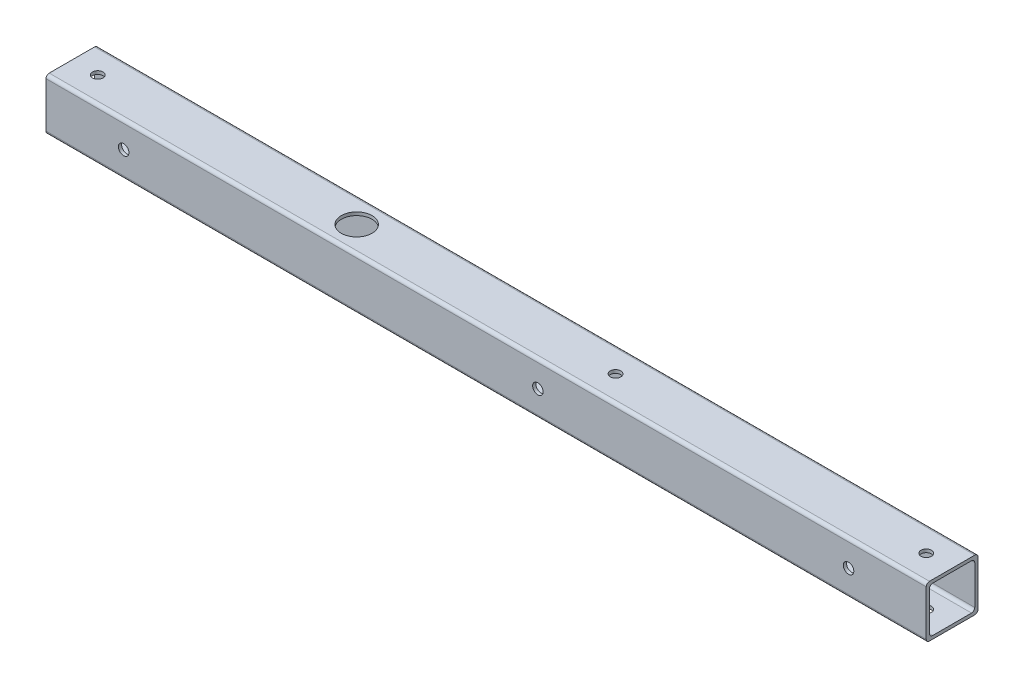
from build123d import *

# Parameters (mm, degrees)
SKETCH1_W          = 1727.2
SKETCH1_H          = 101.6
EXTRUDE1_DEPTH     = 101.6
CUT_EXTRUDE1_REACH = 1735.166
SKETCH2_W          = 88.9
SKETCH2_H          = 88.9
FILLET1_R          = 6.35
SKETCH3_R          = 10.31875
CUT_EXTRUDE2_DEPTH = 101.6
SKETCH4_R          = 10.31875
CUT_EXTRUDE3_DEPTH = 101.6
SKETCH5_R          = 30.1625
CUT_EXTRUDE4_DEPTH = 101.6
SKETCH6_R          = 10.31875
CUT_EXTRUDE5_DEPTH = 101.6
SKETCH7_R          = 10.31875
CUT_EXTRUDE6_DEPTH = 101.6
SKETCH8_R          = 10.31875
CUT_EXTRUDE7_DEPTH = 101.6
SKETCH9_R          = 10.31875
CUT_EXTRUDE8_DEPTH = 101.6


with BuildPart() as part:
    # Sketch1 → Extrude1 (new body)
    with BuildSketch(Plane(origin=(0, 0, 0), x_dir=(1, 0, 0), z_dir=(0, 1, 0))):
        with Locations((-863.6, -50.8)):
            Rectangle(SKETCH1_W, SKETCH1_H)
    extrude(amount=EXTRUDE1_DEPTH)

    # Sketch2 → Cut-Extrude1 (cut, up to next)
    with BuildSketch(Plane.ZY.offset(1727.2), mode=Mode.PRIVATE) as cut_extrude1_sk1:
        with Locations((50.8, 50.8)):
            Rectangle(SKETCH2_W, SKETCH2_H)
    cut_extrude1_tool1 = extrude(cut_extrude1_sk1.sketch, amount=-CUT_EXTRUDE1_REACH, mode=Mode.PRIVATE) & part.part
    add(cut_extrude1_tool1.solids().sort_by_distance((-1727.2, 50.8, 50.8))[0], mode=Mode.SUBTRACT)

    # Fillet1
    fillet1_edges = [part.edges().sort_by_distance(p)[0] for p in [
        (-863.6, 101.6, 101.6),
        (-863.6, 6.35, 6.35),
        (-863.6, 95.25, 6.35),
        (-863.6, 95.25, 95.25),
        (-863.6, 6.35, 95.25),
        (-863.6, 0, 101.6),
        (-863.6, 0, 0),
        (-863.6, 101.6, 0),
    ]]
    fillet(fillet1_edges, radius=FILLET1_R)

    # Sketch3 → Cut-Extrude2 (cut)
    with BuildSketch(Plane(origin=(0, 101.6, 0), x_dir=(1, 0, 0), z_dir=(0, 1, 0))):
        with Locations(Location((-1676.4, -50.8, 0), (0, 0, 270))):
            Circle(SKETCH3_R)
    extrude(amount=-CUT_EXTRUDE2_DEPTH, mode=Mode.SUBTRACT)

    # Sketch4 → Cut-Extrude3 (cut)
    with BuildSketch(Plane(origin=(0, 101.6, 0), x_dir=(1, 0, 0), z_dir=(0, 1, 0))):
        with Locations(Location((-50.8, -50.8, 0), (0, 0, 270))):
            Circle(SKETCH4_R)
    extrude(amount=-CUT_EXTRUDE3_DEPTH, mode=Mode.SUBTRACT)

    # Sketch5 → Cut-Extrude4 (cut)
    with BuildSketch(Plane(origin=(0, 101.6, 0), x_dir=(1, 0, 0), z_dir=(0, 1, 0))):
        with Locations(Location((-1168.4, -50.8, 0), (0, 0, 270))):
            Circle(SKETCH5_R)
    extrude(amount=-CUT_EXTRUDE4_DEPTH, mode=Mode.SUBTRACT)

    # Sketch6 → Cut-Extrude5 (cut)
    with BuildSketch(Plane(origin=(0, 0, 0), x_dir=(-1, 0, 0), z_dir=(0, 0, -1))):
        with Locations((1574.8, 50.8)):
            Circle(SKETCH6_R)
    extrude(amount=-CUT_EXTRUDE5_DEPTH, mode=Mode.SUBTRACT)

    # Sketch7 → Cut-Extrude6 (cut)
    with BuildSketch(Plane(origin=(0, 0, 0), x_dir=(-1, 0, 0), z_dir=(0, 0, -1))):
        with Locations((152.4, 50.8)):
            Circle(SKETCH7_R)
    extrude(amount=-CUT_EXTRUDE6_DEPTH, mode=Mode.SUBTRACT)

    # Sketch8 → Cut-Extrude7 (cut)
    with BuildSketch(Plane(origin=(0, 0, 0), x_dir=(-1, 0, 0), z_dir=(0, 0, -1))):
        with Locations((762, 50.8)):
            Circle(SKETCH8_R)
    extrude(amount=-CUT_EXTRUDE7_DEPTH, mode=Mode.SUBTRACT)

    # Sketch9 → Cut-Extrude8 (cut)
    with BuildSketch(Plane(origin=(0, 101.6, 0), x_dir=(1, 0, 0), z_dir=(0, 1, 0))):
        with Locations(Location((-660.4, -50.8, 0), (0, 0, 270))):
            Circle(SKETCH9_R)
    extrude(amount=-CUT_EXTRUDE8_DEPTH, mode=Mode.SUBTRACT)


solid = part.part
